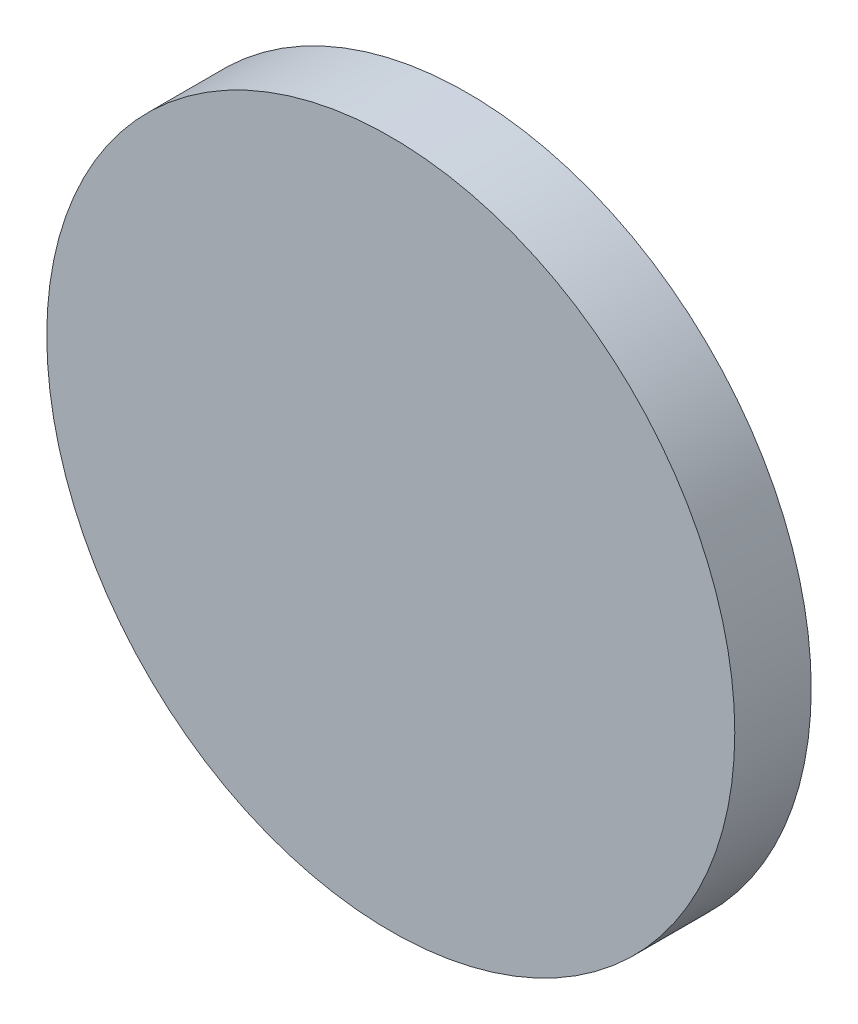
from build123d import *

# Parameters (mm, degrees)
ESQUISSE1_R      = 45
EXTRUSION1_DEPTH = 10


with BuildPart() as part:
    # Esquisse1 → Extrusion1 (new body)
    with BuildSketch(Plane.XY):
        Circle(ESQUISSE1_R)
    extrude(amount=EXTRUSION1_DEPTH)


solid = part.part
